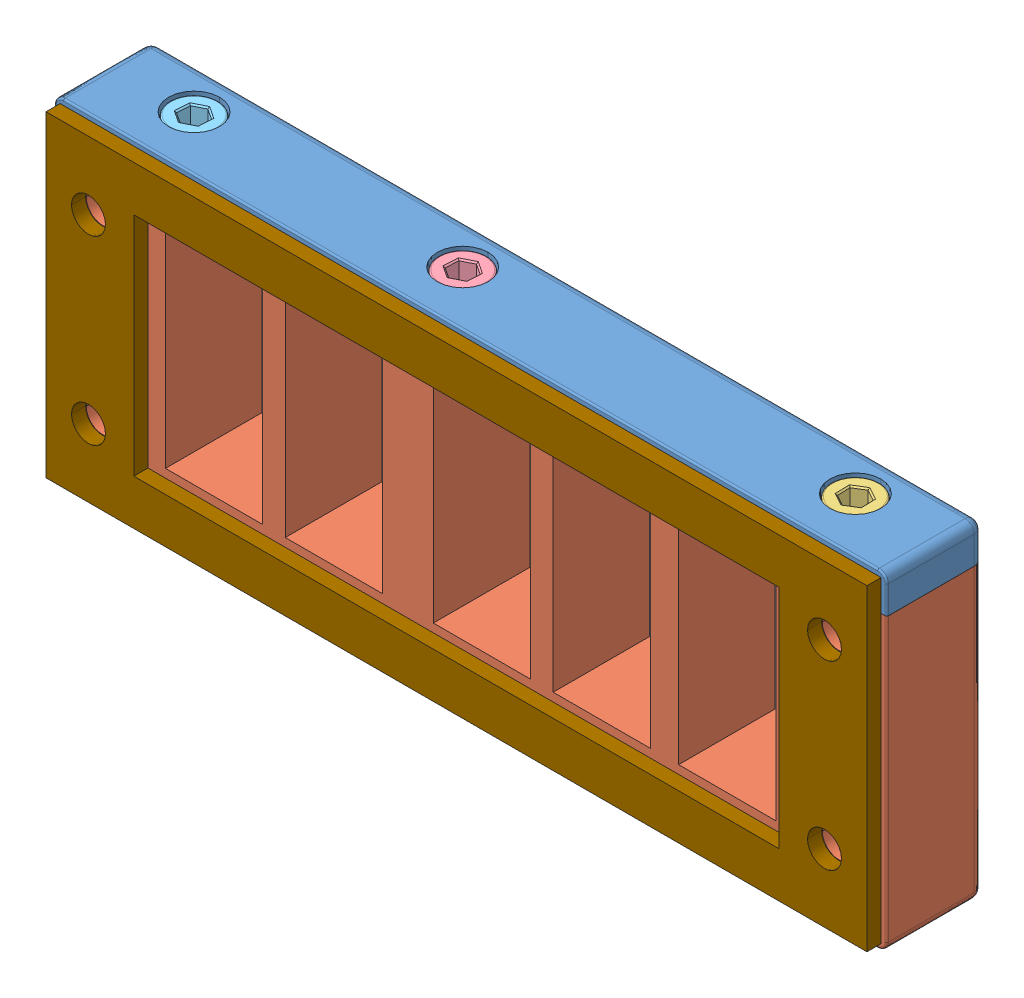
SolidWorks assembly 54241_200.SLDASM, configuration Default (file format 8000). Lengths in mm.
Overall size (147 58 19.55).
9 component instances, 9 part files, 0 mates.
Components (placement in the parent):
- 54241_200_01-1: 54241_200_01.SLDPRT [Default] at origin size (147 10.49 17.05)
- 54241_200_02-1: 54241_200_02.SLDPRT [Default] at origin size (147 51.5 17.05)
- 54241_200_03-1: 54241_200_03.SLDPRT [Default] at origin size (8.5 57 8.5)
- 54241_200_04-1: 54241_200_04.SLDPRT [Default] at origin size (8.5 57 8.5)
- 54241_200_05-1: 54241_200_05.SLDPRT [Default] at origin size (8.5 57 8.5)
- 54241_200_06-1: 54241_200_06.SLDPRT [Default] at origin size (9.25 4.7 8.01)
- 54241_200_07-1: 54241_200_07.SLDPRT [Default] at origin size (9.25 4.7 8.01)
- 54241_200_08-1: 54241_200_08.SLDPRT [Default] at origin size (9.25 4.7 8.01)
- 54241_200_09-1: 54241_200_09.SLDPRT [Default] at origin size (145 56 2.5)
